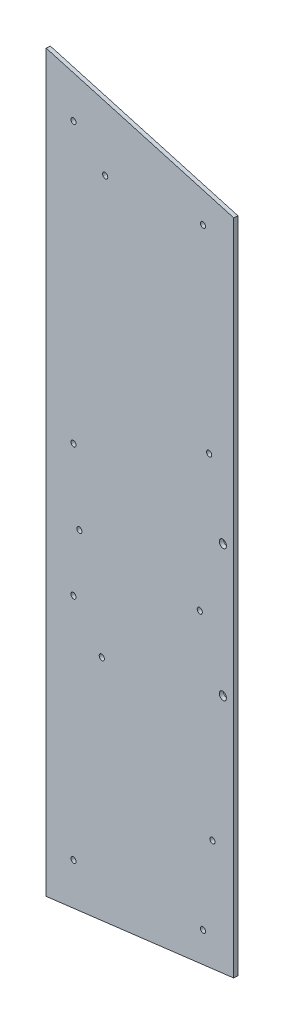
from build123d import *

# Parameters (mm, degrees)
BOSS_EXTRUDE1_DEPTH  = 3.175
CUT_EXTRUDE2_DEPTH   = 880.199971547
M4_CLEARANCE_HOLE1_D = 4.5
SKETCH6_R            = 3.175
CUT_EXTRUDE3_DEPTH   = 460.193465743


with BuildPart() as part:
    # Sketch1 → Boss-Extrude1 (new body)
    with BuildSketch(Plane(origin=(1.950344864, 0, -26.264644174), x_dir=(-0.9972542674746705, 0, -0.07405353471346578), z_dir=(0.07405353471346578, 0, -0.9972542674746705))):
        Polygon((-183.644373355, -298.45), (-183.644373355, 298.45), (-826.760197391, 177.8), (-826.760197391, -177.8), align=None)
    extrude(amount=BOSS_EXTRUDE1_DEPTH)

    # Sketch3 → Cut-Extrude2 (cut, through all)
    with BuildSketch(Plane(origin=(1.950344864, 0, -26.264644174), x_dir=(0.9972542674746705, 0, 0.0740535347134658), z_dir=(-0.0740535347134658, 0, 0.9972542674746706))):
        Polygon((348.744373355, 1759.362905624), (348.744373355, 267.476862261), (348.744373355, -267.476862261), (348.744373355, -1759.362905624), (3332.516460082, -1759.362905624), (3332.516460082, 1759.362905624), align=None)
    extrude(amount=-CUT_EXTRUDE2_DEPTH, mode=Mode.SUBTRACT)

    # M4 Clearance Hole1 (through all)
    with Locations(Plane(origin=(2.185464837, 0, -29.430926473), x_dir=(-0.9972542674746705, 0, -0.0740535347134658), z_dir=(0.0740535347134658, 0, -0.9972542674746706))):
        with Locations((-321.719114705, 248.051870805), (-207.719373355, 260), (-207.719373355, 33), (-207.719373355, -260), (-207.719373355, -74), (-321.719114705, -248.051870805), (-330.006873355, -180.725), (-232.644373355, -104), (-318.894373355, -25), (-212.894373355, -25), (-235.644373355, 236.6), (-327.144373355, 90)):
            Hole(M4_CLEARANCE_HOLE1_D / 2)

    # Sketch6 → Cut-Extrude3 (cut, through all)
    with BuildSketch(Plane(origin=(1.950344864, 0, -26.264644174), x_dir=(0.9972542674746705, 0, 0.0740535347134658), z_dir=(-0.0740535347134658, 0, 0.9972542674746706))):
        with Locations((339.219373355, 33)):
            Circle(SKETCH6_R)
        with Locations((339.219373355, -74)):
            Circle(SKETCH6_R)
    extrude(amount=-CUT_EXTRUDE3_DEPTH, mode=Mode.SUBTRACT)


solid = part.part
